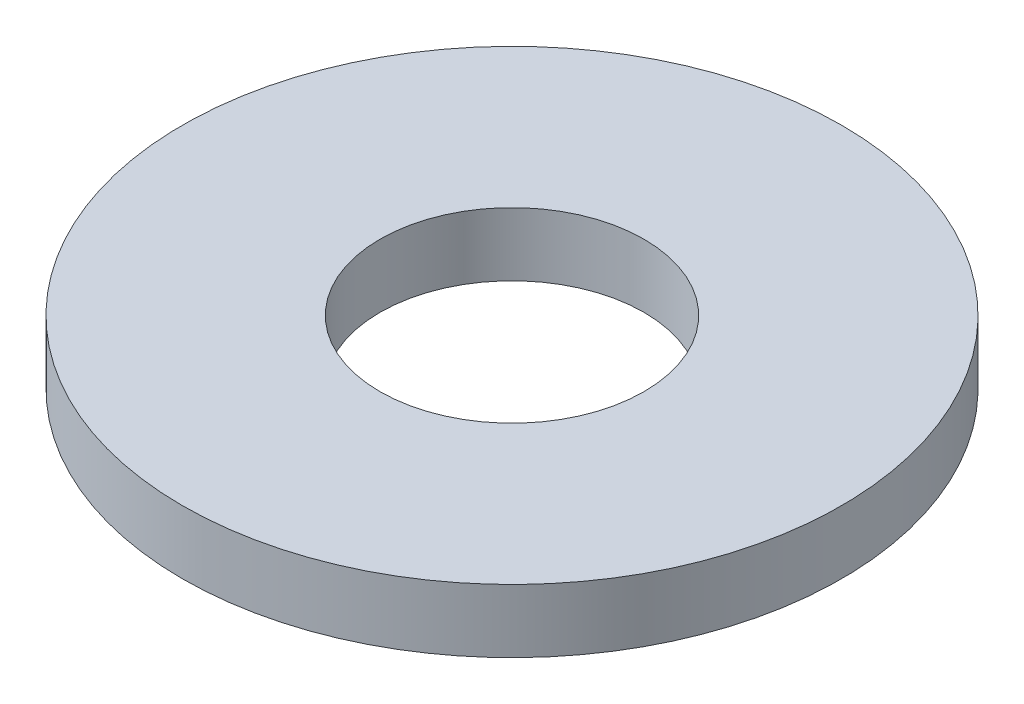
ISO-10303-21;
HEADER;
FILE_DESCRIPTION(('STEP AP214'),'2;1');
FILE_NAME('part.step','',(''),(''),'','','');
FILE_SCHEMA(('AUTOMOTIVE_DESIGN { 1 0 10303 214 1 1 1 1 }'));
ENDSEC;
DATA;
#1=APPLICATION_CONTEXT('core data for automotive mechanical design processes');
#2=APPLICATION_PROTOCOL_DEFINITION('international standard','automotive_design',2000,#1);
#3=PRODUCT_CONTEXT('',#1,'mechanical');
#4=PRODUCT('Part','Part','',(#3));
#5=PRODUCT_RELATED_PRODUCT_CATEGORY('part','',(#4));
#6=PRODUCT_DEFINITION_FORMATION('','',#4);
#7=PRODUCT_DEFINITION_CONTEXT('part definition',#1,'design');
#8=PRODUCT_DEFINITION('design','',#6,#7);
#9=PRODUCT_DEFINITION_SHAPE('','',#8);
#10=(LENGTH_UNIT() NAMED_UNIT(*) SI_UNIT(.MILLI.,.METRE.));
#11=(NAMED_UNIT(*) PLANE_ANGLE_UNIT() SI_UNIT($,.RADIAN.));
#12=(NAMED_UNIT(*) SI_UNIT($,.STERADIAN.) SOLID_ANGLE_UNIT());
#13=UNCERTAINTY_MEASURE_WITH_UNIT(LENGTH_MEASURE(1.E-05),#10,'distance_accuracy_value','');
#14=(GEOMETRIC_REPRESENTATION_CONTEXT(3) GLOBAL_UNCERTAINTY_ASSIGNED_CONTEXT((#13)) GLOBAL_UNIT_ASSIGNED_CONTEXT((#10,
#11,#12)) REPRESENTATION_CONTEXT('',''));
#15=CARTESIAN_POINT('',(0.,0.,0.));
#16=DIRECTION('',(0.,0.,1.));
#17=DIRECTION('',(1.,0.,0.));
#18=AXIS2_PLACEMENT_3D('',#15,#16,#17);
#19=CARTESIAN_POINT('',(0.,0.762,0.));
#20=DIRECTION('',(0.,-1.,0.));
#21=DIRECTION('',(0.,0.,-1.));
#22=AXIS2_PLACEMENT_3D('',#19,#20,#21);
#23=CYLINDRICAL_SURFACE('',#22,3.9624);
#24=CARTESIAN_POINT('',(0.,0.762,0.));
#25=DIRECTION('',(0.,1.,0.));
#26=DIRECTION('',(0.,0.,1.));
#27=AXIS2_PLACEMENT_3D('',#24,#25,#26);
#28=CIRCLE('',#27,3.9624);
#29=CARTESIAN_POINT('',(0.,0.762,-3.9624));
#30=VERTEX_POINT('',#29);
#31=EDGE_CURVE('E10',#30,#30,#28,.T.);
#32=CARTESIAN_POINT('',(0.,0.,0.));
#33=DIRECTION('',(0.,1.,0.));
#34=DIRECTION('',(0.,0.,1.));
#35=AXIS2_PLACEMENT_3D('',#32,#33,#34);
#36=CIRCLE('',#35,3.9624);
#37=CARTESIAN_POINT('',(0.,0.,-3.9624));
#38=VERTEX_POINT('',#37);
#39=EDGE_CURVE('E34',#38,#38,#36,.T.);
#40=CARTESIAN_POINT('',(0.,0.762,-3.9624));
#41=CARTESIAN_POINT('',(0.,0.7540625,-3.9624));
#42=CARTESIAN_POINT('',(0.,0.746125,-3.9624));
#43=CARTESIAN_POINT('',(0.,0.73025,-3.9624));
#44=CARTESIAN_POINT('',(0.,0.7223125,-3.9624));
#45=CARTESIAN_POINT('',(0.,0.7064375,-3.9624));
#46=CARTESIAN_POINT('',(0.,0.6985,-3.9624));
#47=CARTESIAN_POINT('',(0.,0.682625,-3.9624));
#48=CARTESIAN_POINT('',(0.,0.6746875,-3.9624));
#49=CARTESIAN_POINT('',(0.,0.6588125,-3.9624));
#50=CARTESIAN_POINT('',(0.,0.650875,-3.9624));
#51=CARTESIAN_POINT('',(0.,0.635,-3.9624));
#52=CARTESIAN_POINT('',(0.,0.6270625,-3.9624));
#53=CARTESIAN_POINT('',(0.,0.6111875,-3.9624));
#54=CARTESIAN_POINT('',(0.,0.60325,-3.9624));
#55=CARTESIAN_POINT('',(0.,0.587375,-3.9624));
#56=CARTESIAN_POINT('',(0.,0.5794375,-3.9624));
#57=CARTESIAN_POINT('',(0.,0.5635625,-3.9624));
#58=CARTESIAN_POINT('',(0.,0.555625,-3.9624));
#59=CARTESIAN_POINT('',(0.,0.53975,-3.9624));
#60=CARTESIAN_POINT('',(0.,0.5318125,-3.9624));
#61=CARTESIAN_POINT('',(0.,0.5159375,-3.9624));
#62=CARTESIAN_POINT('',(0.,0.508,-3.9624));
#63=CARTESIAN_POINT('',(0.,0.492125,-3.9624));
#64=CARTESIAN_POINT('',(0.,0.4841875,-3.9624));
#65=CARTESIAN_POINT('',(0.,0.4683125,-3.9624));
#66=CARTESIAN_POINT('',(0.,0.460375,-3.9624));
#67=CARTESIAN_POINT('',(0.,0.4445,-3.9624));
#68=CARTESIAN_POINT('',(0.,0.4365625,-3.9624));
#69=CARTESIAN_POINT('',(0.,0.4206875,-3.9624));
#70=CARTESIAN_POINT('',(0.,0.41275,-3.9624));
#71=CARTESIAN_POINT('',(0.,0.396875,-3.9624));
#72=CARTESIAN_POINT('',(0.,0.3889375,-3.9624));
#73=CARTESIAN_POINT('',(0.,0.3730625,-3.9624));
#74=CARTESIAN_POINT('',(0.,0.365125,-3.9624));
#75=CARTESIAN_POINT('',(0.,0.34925,-3.9624));
#76=CARTESIAN_POINT('',(0.,0.3413125,-3.9624));
#77=CARTESIAN_POINT('',(0.,0.3254375,-3.9624));
#78=CARTESIAN_POINT('',(0.,0.3175,-3.9624));
#79=CARTESIAN_POINT('',(0.,0.301625,-3.9624));
#80=CARTESIAN_POINT('',(0.,0.2936875,-3.9624));
#81=CARTESIAN_POINT('',(0.,0.2778125,-3.9624));
#82=CARTESIAN_POINT('',(0.,0.269875,-3.9624));
#83=CARTESIAN_POINT('',(0.,0.254,-3.9624));
#84=CARTESIAN_POINT('',(0.,0.2460625,-3.9624));
#85=CARTESIAN_POINT('',(0.,0.2301875,-3.9624));
#86=CARTESIAN_POINT('',(0.,0.22225,-3.9624));
#87=CARTESIAN_POINT('',(0.,0.206375,-3.9624));
#88=CARTESIAN_POINT('',(0.,0.1984375,-3.9624));
#89=CARTESIAN_POINT('',(0.,0.1825625,-3.9624));
#90=CARTESIAN_POINT('',(0.,0.174625,-3.9624));
#91=CARTESIAN_POINT('',(0.,0.15875,-3.9624));
#92=CARTESIAN_POINT('',(0.,0.1508125,-3.9624));
#93=CARTESIAN_POINT('',(0.,0.1349375,-3.9624));
#94=CARTESIAN_POINT('',(0.,0.127,-3.9624));
#95=CARTESIAN_POINT('',(0.,0.111125,-3.9624));
#96=CARTESIAN_POINT('',(0.,0.1031875,-3.9624));
#97=CARTESIAN_POINT('',(0.,0.0873125,-3.9624));
#98=CARTESIAN_POINT('',(0.,0.079375,-3.9624));
#99=CARTESIAN_POINT('',(0.,0.0635,-3.9624));
#100=CARTESIAN_POINT('',(0.,0.0555625,-3.9624));
#101=CARTESIAN_POINT('',(0.,0.0396875,-3.9624));
#102=CARTESIAN_POINT('',(0.,0.03175,-3.9624));
#103=CARTESIAN_POINT('',(0.,0.015875,-3.9624));
#104=CARTESIAN_POINT('',(0.,0.00793749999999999,-3.9624));
#105=CARTESIAN_POINT('',(0.,0.,-3.9624));
#106=B_SPLINE_CURVE_WITH_KNOTS('',3,(#40,#41,#42,#43,#44,#45,#46,#47,#48,#49,#50,#51,#52,#53,
#54,#55,#56,#57,#58,#59,#60,#61,#62,#63,#64,#65,#66,#67,#68,#69,#70,#71,#72,#73,#74,#75,#76,#77,
#78,#79,#80,#81,#82,#83,#84,#85,#86,#87,#88,#89,#90,#91,#92,#93,#94,#95,#96,#97,#98,#99,#100,
#101,#102,#103,#104,#105),.UNSPECIFIED.,.F.,.F.,(4,2,2,2,2,2,2,2,2,2,2,2,2,2,2,2,2,2,2,2,2,2,2,
2,2,2,2,2,2,2,2,2,4),(0.,0.0238125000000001,0.047625,0.0714375,0.0952500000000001,0.1190625,
0.142875,0.1666875,0.1905,0.2143125,0.238125,0.2619375,0.28575,0.3095625,0.333375,0.3571875,
0.381,0.4048125,0.428625,0.4524375,0.47625,0.5000625,0.523875,0.5476875,0.5715,0.5953125,
0.619125,0.6429375,0.66675,0.6905625,0.714375,0.7381875,0.762),.UNSPECIFIED.);
#107=EDGE_CURVE('BSEAM31',#30,#38,#106,.T.);
#108=ORIENTED_EDGE('',*,*,#31,.F.);
#109=ORIENTED_EDGE('',*,*,#39,.T.);
#110=ORIENTED_EDGE('',*,*,#107,.T.);
#111=ORIENTED_EDGE('',*,*,#107,.F.);
#112=EDGE_LOOP('',(#108,#110,#109,#111));
#113=FACE_BOUND('',#112,.T.);
#114=ADVANCED_FACE('F31',(#113),#23,.T.);
#115=CARTESIAN_POINT('',(0.,0.762,0.));
#116=DIRECTION('',(0.,1.,0.));
#117=DIRECTION('',(0.,0.,1.));
#118=AXIS2_PLACEMENT_3D('',#115,#116,#117);
#119=PLANE('',#118);
#120=CARTESIAN_POINT('',(0.,0.762,0.));
#121=DIRECTION('',(0.,1.,0.));
#122=DIRECTION('',(0.,0.,1.));
#123=AXIS2_PLACEMENT_3D('',#120,#121,#122);
#124=CIRCLE('',#123,1.5875);
#125=CARTESIAN_POINT('',(0.,0.762,1.5875));
#126=VERTEX_POINT('',#125);
#127=EDGE_CURVE('E43',#126,#126,#124,.T.);
#128=ORIENTED_EDGE('',*,*,#127,.F.);
#129=EDGE_LOOP('',(#128));
#130=FACE_BOUND('',#129,.T.);
#131=ORIENTED_EDGE('',*,*,#31,.T.);
#132=EDGE_LOOP('',(#131));
#133=FACE_BOUND('',#132,.T.);
#134=ADVANCED_FACE('F58',(#130,#133),#119,.T.);
#135=CARTESIAN_POINT('',(0.,0.,0.));
#136=DIRECTION('',(0.,1.,0.));
#137=DIRECTION('',(0.,0.,1.));
#138=AXIS2_PLACEMENT_3D('',#135,#136,#137);
#139=PLANE('',#138);
#140=CARTESIAN_POINT('',(0.,0.,0.));
#141=DIRECTION('',(0.,1.,0.));
#142=DIRECTION('',(0.,0.,1.));
#143=AXIS2_PLACEMENT_3D('',#140,#141,#142);
#144=CIRCLE('',#143,1.5875);
#145=CARTESIAN_POINT('',(0.,0.,1.5875));
#146=VERTEX_POINT('',#145);
#147=EDGE_CURVE('E41',#146,#146,#144,.T.);
#148=ORIENTED_EDGE('',*,*,#147,.T.);
#149=EDGE_LOOP('',(#148));
#150=FACE_BOUND('',#149,.T.);
#151=ORIENTED_EDGE('',*,*,#39,.F.);
#152=EDGE_LOOP('',(#151));
#153=FACE_BOUND('',#152,.T.);
#154=ADVANCED_FACE('F49',(#150,#153),#139,.F.);
#155=CARTESIAN_POINT('',(0.,0.,0.));
#156=DIRECTION('',(0.,1.,0.));
#157=DIRECTION('',(0.,0.,1.));
#158=AXIS2_PLACEMENT_3D('',#155,#156,#157);
#159=CYLINDRICAL_SURFACE('',#158,1.5875);
#160=CARTESIAN_POINT('',(0.,0.,1.5875));
#161=CARTESIAN_POINT('',(0.,0.0079375,1.5875));
#162=CARTESIAN_POINT('',(0.,0.015875,1.5875));
#163=CARTESIAN_POINT('',(0.,0.03175,1.5875));
#164=CARTESIAN_POINT('',(0.,0.0396875,1.5875));
#165=CARTESIAN_POINT('',(0.,0.0555625,1.5875));
#166=CARTESIAN_POINT('',(0.,0.0635,1.5875));
#167=CARTESIAN_POINT('',(0.,0.079375,1.5875));
#168=CARTESIAN_POINT('',(0.,0.0873125,1.5875));
#169=CARTESIAN_POINT('',(0.,0.1031875,1.5875));
#170=CARTESIAN_POINT('',(0.,0.111125,1.5875));
#171=CARTESIAN_POINT('',(0.,0.127,1.5875));
#172=CARTESIAN_POINT('',(0.,0.1349375,1.5875));
#173=CARTESIAN_POINT('',(0.,0.1508125,1.5875));
#174=CARTESIAN_POINT('',(0.,0.15875,1.5875));
#175=CARTESIAN_POINT('',(0.,0.174625,1.5875));
#176=CARTESIAN_POINT('',(0.,0.1825625,1.5875));
#177=CARTESIAN_POINT('',(0.,0.1984375,1.5875));
#178=CARTESIAN_POINT('',(0.,0.206375,1.5875));
#179=CARTESIAN_POINT('',(0.,0.22225,1.5875));
#180=CARTESIAN_POINT('',(0.,0.2301875,1.5875));
#181=CARTESIAN_POINT('',(0.,0.2460625,1.5875));
#182=CARTESIAN_POINT('',(0.,0.254,1.5875));
#183=CARTESIAN_POINT('',(0.,0.269875,1.5875));
#184=CARTESIAN_POINT('',(0.,0.2778125,1.5875));
#185=CARTESIAN_POINT('',(0.,0.2936875,1.5875));
#186=CARTESIAN_POINT('',(0.,0.301625,1.5875));
#187=CARTESIAN_POINT('',(0.,0.3175,1.5875));
#188=CARTESIAN_POINT('',(0.,0.3254375,1.5875));
#189=CARTESIAN_POINT('',(0.,0.3413125,1.5875));
#190=CARTESIAN_POINT('',(0.,0.34925,1.5875));
#191=CARTESIAN_POINT('',(0.,0.365125,1.5875));
#192=CARTESIAN_POINT('',(0.,0.3730625,1.5875));
#193=CARTESIAN_POINT('',(0.,0.3889375,1.5875));
#194=CARTESIAN_POINT('',(0.,0.396875,1.5875));
#195=CARTESIAN_POINT('',(0.,0.41275,1.5875));
#196=CARTESIAN_POINT('',(0.,0.4206875,1.5875));
#197=CARTESIAN_POINT('',(0.,0.4365625,1.5875));
#198=CARTESIAN_POINT('',(0.,0.4445,1.5875));
#199=CARTESIAN_POINT('',(0.,0.460375,1.5875));
#200=CARTESIAN_POINT('',(0.,0.4683125,1.5875));
#201=CARTESIAN_POINT('',(0.,0.4841875,1.5875));
#202=CARTESIAN_POINT('',(0.,0.492125,1.5875));
#203=CARTESIAN_POINT('',(0.,0.508,1.5875));
#204=CARTESIAN_POINT('',(0.,0.5159375,1.5875));
#205=CARTESIAN_POINT('',(0.,0.5318125,1.5875));
#206=CARTESIAN_POINT('',(0.,0.53975,1.5875));
#207=CARTESIAN_POINT('',(0.,0.555625,1.5875));
#208=CARTESIAN_POINT('',(0.,0.5635625,1.5875));
#209=CARTESIAN_POINT('',(0.,0.5794375,1.5875));
#210=CARTESIAN_POINT('',(0.,0.587375,1.5875));
#211=CARTESIAN_POINT('',(0.,0.60325,1.5875));
#212=CARTESIAN_POINT('',(0.,0.6111875,1.5875));
#213=CARTESIAN_POINT('',(0.,0.6270625,1.5875));
#214=CARTESIAN_POINT('',(0.,0.635,1.5875));
#215=CARTESIAN_POINT('',(0.,0.650875,1.5875));
#216=CARTESIAN_POINT('',(0.,0.6588125,1.5875));
#217=CARTESIAN_POINT('',(0.,0.6746875,1.5875));
#218=CARTESIAN_POINT('',(0.,0.682625,1.5875));
#219=CARTESIAN_POINT('',(0.,0.6985,1.5875));
#220=CARTESIAN_POINT('',(0.,0.7064375,1.5875));
#221=CARTESIAN_POINT('',(0.,0.7223125,1.5875));
#222=CARTESIAN_POINT('',(0.,0.73025,1.5875));
#223=CARTESIAN_POINT('',(0.,0.746125,1.5875));
#224=CARTESIAN_POINT('',(0.,0.7540625,1.5875));
#225=CARTESIAN_POINT('',(0.,0.762,1.5875));
#226=B_SPLINE_CURVE_WITH_KNOTS('',3,(#160,#161,#162,#163,#164,#165,#166,#167,#168,#169,#170,
#171,#172,#173,#174,#175,#176,#177,#178,#179,#180,#181,#182,#183,#184,#185,#186,#187,#188,#189,
#190,#191,#192,#193,#194,#195,#196,#197,#198,#199,#200,#201,#202,#203,#204,#205,#206,#207,#208,
#209,#210,#211,#212,#213,#214,#215,#216,#217,#218,#219,#220,#221,#222,#223,#224,#225),
.UNSPECIFIED.,.F.,.F.,(4,2,2,2,2,2,2,2,2,2,2,2,2,2,2,2,2,2,2,2,2,2,2,2,2,2,2,2,2,2,2,2,4),(0.,
0.0238125,0.047625,0.0714375,0.09525,0.1190625,0.142875,0.1666875,0.1905,0.2143125,0.238125,
0.2619375,0.28575,0.3095625,0.333375,0.3571875,0.381,0.4048125,0.428625,0.4524375,0.47625,
0.5000625,0.523875,0.5476875,0.5715,0.5953125,0.619125,0.6429375,0.66675,0.6905625,0.714375,
0.7381875,0.762),.UNSPECIFIED.);
#227=EDGE_CURVE('BSEAM52',#146,#126,#226,.T.);
#228=ORIENTED_EDGE('',*,*,#147,.F.);
#229=ORIENTED_EDGE('',*,*,#127,.T.);
#230=ORIENTED_EDGE('',*,*,#227,.T.);
#231=ORIENTED_EDGE('',*,*,#227,.F.);
#232=EDGE_LOOP('',(#228,#230,#229,#231));
#233=FACE_BOUND('',#232,.T.);
#234=ADVANCED_FACE('F52',(#233),#159,.F.);
#235=CLOSED_SHELL('',(#114,#134,#154,#234));
#236=MANIFOLD_SOLID_BREP('B2',#235);
#237=ADVANCED_BREP_SHAPE_REPRESENTATION('',(#18,#236),#14);
#238=SHAPE_DEFINITION_REPRESENTATION(#9,#237);
ENDSEC;
END-ISO-10303-21;
